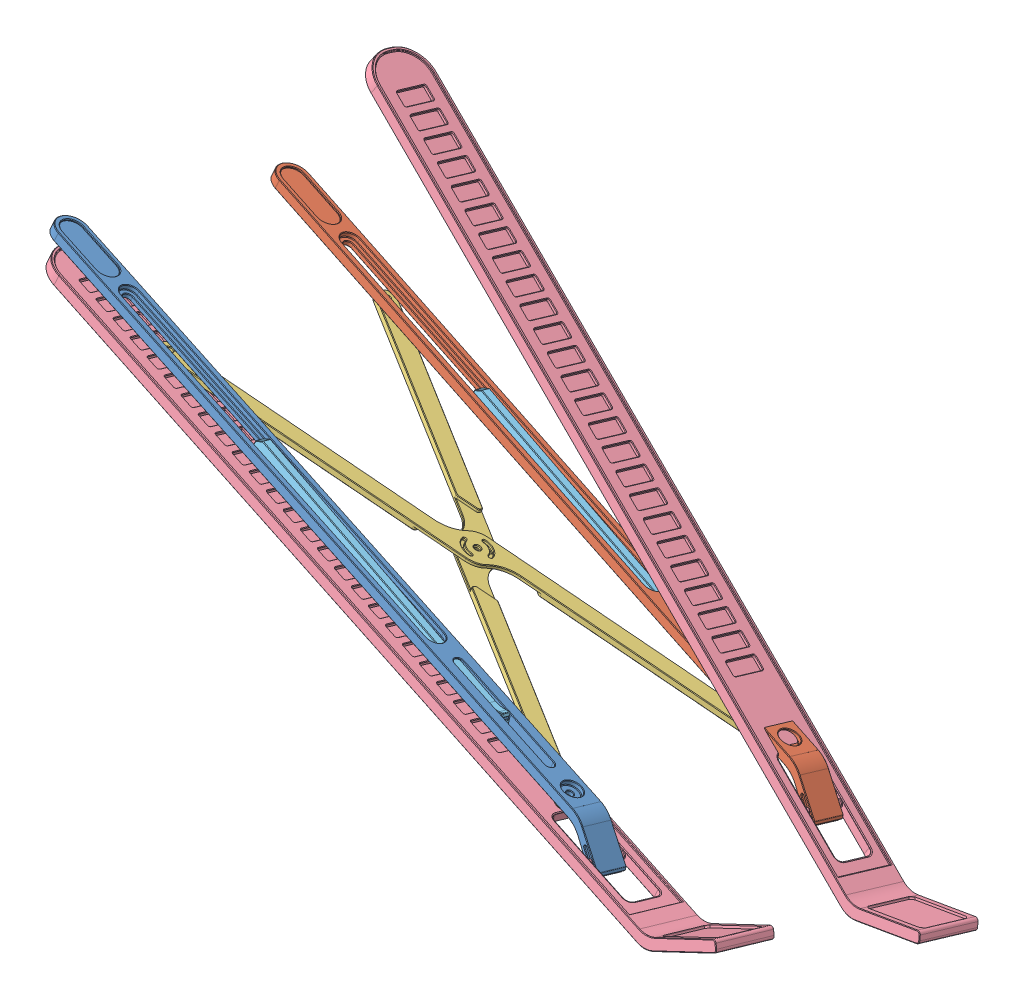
SolidWorks assembly 装配体.SLDASM, configuration 默认 (file format 15000). Lengths in mm.
Overall size (271.98 156.54 138.55).
8 component instances, 5 part files, 17 mates.
Components (placement in the parent):
- 小架子-1: 小架子.SLDPRT [默认] at (-97.2907 217.0691 256.3866) x (0.952949 -0.280744 0.114328) z (-0.041997 0.251244 0.967012) size (231.44 10.31 10)
- 镜像小架子-3: 镜像小架子.SLDPRT [默认] at (-90.7663 180.4379 115.9262) x (0.952676 -0.279207 0.12022) z (-0.047805 0.252951 0.966297) size (231.44 10.31 10)
- 镜像中心架子-6: 镜像中心架子.SLDPRT [默认] at (-102.8489 194.0831 155.5186) x (-0.318979 -0.127412 -0.939159) z (-0.89896 0.354552 0.257225) size (12.43 2 185.86)
- 镜像中心架子-8: 镜像中心架子.SLDPRT [默认] at (-106.1791 207.5569 214.7422) x (-0.402104 0.339295 0.850406) z (-0.864979 0.163766 -0.474334) size (12.43 2 185.86)
- 完成的大件1-1: 完成的大件1.SLDPRT [默认] at (-139.3119 220.9717 240.502) x (0.041997 -0.251244 -0.967012) z (0.952083 -0.283404 0.114981) size (20 19.04 270.83)
- 完成的大件1-2: 完成的大件1.SLDPRT [默认] at (-120.2237 236.4568 159.9329) x (0.047805 -0.252951 -0.966297) z (0.847855 -0.501164 0.173137) size (20 19.04 270.83)
- 支撑架子-1: 支撑架子.SLDPRT [默认] at (-66.4557 182.7657 151.6457) x (0.947783 -0.293897 0.123823) z (-0.047805 0.252951 0.966297) size (102.12 4.28 2.8)
- 支撑架子-2: 支撑架子.SLDPRT [默认] at (-69.745 201.7314 223.5721) x (0.946417 -0.300184 0.119095) z (-0.041997 0.251244 0.967012) size (102.12 4.28 2.8)
Mates (geometry in assembly coordinates):
- 重合12: coincident anti-aligned: plane of 镜向完成支撑件-6 through (-103.1491 193.1568 155.7462) normal (-0.300207 -0.926315 0.227633); plane of 镜向完成支撑件-8 through (-105.8788 208.4832 214.5146) normal (0.300207 0.926315 -0.227633)
- 同心12: concentric anti-aligned: cylinder of 镜向完成支撑件-6 through (-80.9653 197.4513 187.1028) axis (-0.300207 -0.926315 0.227633) radius 1; cylinder of 镜向完成支撑件-8 through (-83.0668 190.9671 188.6962) axis (0.300207 0.926315 -0.227633) radius 1
- 重合21: coincident anti-aligned: plane of 完成零件小的-1 through (-97.2907 217.0691 256.3866) normal (-0.300207 -0.926315 0.227633); plane of 镜向完成支撑件-6 through (-102.8489 194.0831 155.5186) normal (0.300207 0.926315 -0.227633)
- 相切16: tangent anti-aligned: plane of 完成零件小的-1 through (-95.2924 209.198 220.4024) normal (-0.041997 0.251244 0.967012); cylinder of 镜向完成支撑件-6 through (-162.1335 225.5769 214.2782) axis (0.300207 0.926315 -0.227633) radius 1
- 相切17: tangent anti-aligned: plane of 镜向完成零件小的-3 through (-92.078 191.1508 151.2011) normal (0.047805 -0.252951 -0.966297); cylinder of 镜向完成支撑件-8 through (-158.21 208.7721 142.2817) axis (-0.300207 -0.926315 0.227633) radius 1
- 同心16: concentric aligned: cylinder of 完成零件小的-1 through (-4.7714 182.8884 232.7205) axis (-0.300207 -0.926315 0.227633) radius 1; cylinder of 镜向完成支撑件-8 through (-5.2217 181.4989 233.062) axis (-0.300207 -0.926315 0.227633) radius 1
- 同心17: concentric anti-aligned: cylinder of 镜向完成零件小的-3 through (-1.4483 164.2309 161.1793) axis (-0.300207 -0.926315 0.227633) radius 1; cylinder of 镜向完成支撑件-6 through (-2.4991 160.9888 161.9761) axis (0.300207 0.926315 -0.227633) radius 1
- 同心18: concentric aligned: cylinder of 完成零件小的-1 through (10.6529 171.2322 231.2483) axis (-0.041997 0.251244 0.967012) radius 0.5; cylinder of 完成的大件1-1 through (10.8209 170.2272 227.3802) axis (-0.041997 0.251244 0.967012) radius 1
- 平行4: parallel anti-aligned: plane of 完成零件小的-1 through (-94.6951 209.7081 216.6764) normal (0.041997 -0.251244 -0.967012); plane of 完成的大件1-1 through (-141.1342 204.4951 214.9799) normal (-0.041997 0.251244 0.967012)
- 距离1: distance = 1 mm anti-aligned: plane of 完成零件小的-1 through (-94.6951 209.7081 216.6764) normal (0.041997 -0.251244 -0.967012); plane of 完成的大件1-1 through (-141.1342 204.4951 214.9799) normal (-0.041997 0.251244 0.967012)
- 同心19: concentric anti-aligned: cylinder of 镜向完成零件小的-3 through (13.5221 155.123 169.4786) axis (0.047805 -0.252951 -0.966297) radius 0.5; cylinder of 完成的大件1-2 through (14.1913 151.5817 155.9504) axis (-0.047805 0.252951 0.966297) radius 1
- 距离2: distance = 1 mm anti-aligned: plane of 完成的大件1-2 through (-124.7039 223.9461 145.659) normal (0.047805 -0.252951 -0.966297); plane of 镜向完成零件小的-3 through (-91.795 193.4256 154.2417) normal (-0.047805 0.252951 0.966297)
- 重合26: coincident anti-aligned: plane of 镜向完成零件小的-3 through (-90.7663 180.4379 115.9262) normal (-0.300207 -0.926315 0.227633); plane of 镜向完成支撑件-8 through (-105.5786 209.4095 214.287) normal (0.300207 0.926315 -0.227633)
- 同心20: concentric anti-aligned: cylinder of 镜向完成零件小的-3 through (-27.9746 171.5234 155.8715) axis (-0.047805 0.252951 0.966297) radius 1; cylinder of 最小的支撑件1-1 through (-28.1371 172.3834 159.1569) axis (0.047805 -0.252951 -0.966297) radius 0.5
- 距离3: distance = 0.1 mm anti-aligned: plane of 最小的支撑件1-1 through (-123.5637 199.1489 144.5318) normal (0.047805 -0.252951 -0.966297); plane of 镜向完成零件小的-3 through (-44.3936 180.512 153.2236) normal (-0.047805 0.252951 0.966297)
- 同心21: concentric aligned: cylinder of 完成零件小的-1 through (-31.4864 191.2404 231.4754) axis (0.041997 -0.251244 -0.967012) radius 1; cylinder of 最小的支撑件1-2 through (-31.4612 191.0896 230.8952) axis (0.041997 -0.251244 -0.967012) radius 0.5
- 距离4: distance = 0.1 mm anti-aligned: plane of 最小的支撑件1-2 through (-126.7776 218.4927 216.7404) normal (0.041997 -0.251244 -0.967012); plane of 完成零件小的-1 through (-47.7395 199.2516 225.0687) normal (-0.041997 0.251244 0.967012)
